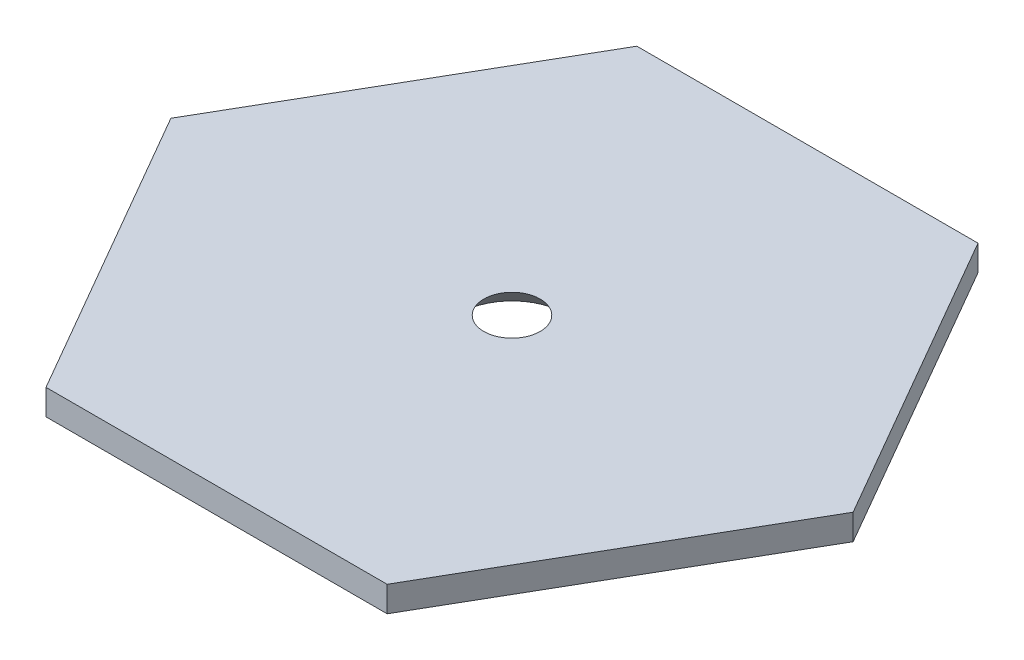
ISO-10303-21;
HEADER;
FILE_DESCRIPTION(('STEP AP214'),'2;1');
FILE_NAME('part.step','',(''),(''),'','','');
FILE_SCHEMA(('AUTOMOTIVE_DESIGN { 1 0 10303 214 1 1 1 1 }'));
ENDSEC;
DATA;
#1=APPLICATION_CONTEXT('core data for automotive mechanical design processes');
#2=APPLICATION_PROTOCOL_DEFINITION('international standard','automotive_design',2000,#1);
#3=PRODUCT_CONTEXT('',#1,'mechanical');
#4=PRODUCT('Part','Part','',(#3));
#5=PRODUCT_RELATED_PRODUCT_CATEGORY('part','',(#4));
#6=PRODUCT_DEFINITION_FORMATION('','',#4);
#7=PRODUCT_DEFINITION_CONTEXT('part definition',#1,'design');
#8=PRODUCT_DEFINITION('design','',#6,#7);
#9=PRODUCT_DEFINITION_SHAPE('','',#8);
#10=(LENGTH_UNIT() NAMED_UNIT(*) SI_UNIT(.MILLI.,.METRE.));
#11=(NAMED_UNIT(*) PLANE_ANGLE_UNIT() SI_UNIT($,.RADIAN.));
#12=(NAMED_UNIT(*) SI_UNIT($,.STERADIAN.) SOLID_ANGLE_UNIT());
#13=UNCERTAINTY_MEASURE_WITH_UNIT(LENGTH_MEASURE(1.E-05),#10,'distance_accuracy_value','');
#14=(GEOMETRIC_REPRESENTATION_CONTEXT(3) GLOBAL_UNCERTAINTY_ASSIGNED_CONTEXT((#13)) GLOBAL_UNIT_ASSIGNED_CONTEXT((#10,
#11,#12)) REPRESENTATION_CONTEXT('',''));
#15=CARTESIAN_POINT('',(0.,0.,0.));
#16=DIRECTION('',(0.,0.,1.));
#17=DIRECTION('',(1.,0.,0.));
#18=AXIS2_PLACEMENT_3D('',#15,#16,#17);
#19=CARTESIAN_POINT('',(20.,3.,34.6410161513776));
#20=DIRECTION('',(-0.866025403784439,0.,-0.5));
#21=DIRECTION('',(-0.5,0.,0.866025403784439));
#22=AXIS2_PLACEMENT_3D('',#19,#20,#21);
#23=PLANE('',#22);
#24=DIRECTION('',(0.5,0.,-0.866025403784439));
#25=VECTOR('',#24,1.);
#26=CARTESIAN_POINT('',(20.,0.,34.6410161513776));
#27=LINE('',#26,#25);
#28=CARTESIAN_POINT('',(20.,0.,34.6410161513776));
#29=VERTEX_POINT('',#28);
#30=CARTESIAN_POINT('',(40.,0.,0.));
#31=VERTEX_POINT('',#30);
#32=EDGE_CURVE('E86',#29,#31,#27,.T.);
#33=ORIENTED_EDGE('',*,*,#32,.T.);
#34=DIRECTION('',(0.,-1.,0.));
#35=VECTOR('',#34,1.);
#36=CARTESIAN_POINT('',(40.,3.,0.));
#37=LINE('',#36,#35);
#38=CARTESIAN_POINT('',(40.,3.,0.));
#39=VERTEX_POINT('',#38);
#40=EDGE_CURVE('E11',#39,#31,#37,.T.);
#41=ORIENTED_EDGE('',*,*,#40,.F.);
#42=DIRECTION('',(0.5,0.,-0.866025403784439));
#43=VECTOR('',#42,1.);
#44=CARTESIAN_POINT('',(20.,3.,34.6410161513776));
#45=LINE('',#44,#43);
#46=CARTESIAN_POINT('',(20.,3.,34.6410161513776));
#47=VERTEX_POINT('',#46);
#48=EDGE_CURVE('E114',#47,#39,#45,.T.);
#49=ORIENTED_EDGE('',*,*,#48,.F.);
#50=DIRECTION('',(0.,-1.,0.));
#51=VECTOR('',#50,1.);
#52=CARTESIAN_POINT('',(20.,3.,34.6410161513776));
#53=LINE('',#52,#51);
#54=EDGE_CURVE('E99',#47,#29,#53,.T.);
#55=ORIENTED_EDGE('',*,*,#54,.T.);
#56=EDGE_LOOP('',(#33,#41,#49,#55));
#57=FACE_BOUND('',#56,.T.);
#58=ADVANCED_FACE('F30',(#57),#23,.F.);
#59=CARTESIAN_POINT('',(40.,3.,0.));
#60=DIRECTION('',(-0.866025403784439,0.,0.5));
#61=DIRECTION('',(0.5,0.,0.866025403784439));
#62=AXIS2_PLACEMENT_3D('',#59,#60,#61);
#63=PLANE('',#62);
#64=DIRECTION('',(-0.5,0.,-0.866025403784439));
#65=VECTOR('',#64,1.);
#66=CARTESIAN_POINT('',(40.,0.,0.));
#67=LINE('',#66,#65);
#68=CARTESIAN_POINT('',(20.,0.,-34.6410161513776));
#69=VERTEX_POINT('',#68);
#70=EDGE_CURVE('E82',#31,#69,#67,.T.);
#71=ORIENTED_EDGE('',*,*,#70,.T.);
#72=DIRECTION('',(0.,-1.,0.));
#73=VECTOR('',#72,1.);
#74=CARTESIAN_POINT('',(20.,3.,-34.6410161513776));
#75=LINE('',#74,#73);
#76=CARTESIAN_POINT('',(20.,3.,-34.6410161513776));
#77=VERTEX_POINT('',#76);
#78=EDGE_CURVE('E37',#77,#69,#75,.T.);
#79=ORIENTED_EDGE('',*,*,#78,.F.);
#80=DIRECTION('',(-0.5,0.,-0.866025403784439));
#81=VECTOR('',#80,1.);
#82=CARTESIAN_POINT('',(40.,3.,0.));
#83=LINE('',#82,#81);
#84=EDGE_CURVE('E95',#39,#77,#83,.T.);
#85=ORIENTED_EDGE('',*,*,#84,.F.);
#86=ORIENTED_EDGE('',*,*,#40,.T.);
#87=EDGE_LOOP('',(#71,#79,#85,#86));
#88=FACE_BOUND('',#87,.T.);
#89=ADVANCED_FACE('F94',(#88),#63,.F.);
#90=CARTESIAN_POINT('',(20.,3.,-34.6410161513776));
#91=DIRECTION('',(0.,0.,1.));
#92=DIRECTION('',(1.,0.,0.));
#93=AXIS2_PLACEMENT_3D('',#90,#91,#92);
#94=PLANE('',#93);
#95=DIRECTION('',(-1.,0.,0.));
#96=VECTOR('',#95,1.);
#97=CARTESIAN_POINT('',(20.,0.,-34.6410161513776));
#98=LINE('',#97,#96);
#99=CARTESIAN_POINT('',(-20.,0.,-34.6410161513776));
#100=VERTEX_POINT('',#99);
#101=EDGE_CURVE('E88',#69,#100,#98,.T.);
#102=ORIENTED_EDGE('',*,*,#101,.T.);
#103=DIRECTION('',(0.,-1.,0.));
#104=VECTOR('',#103,1.);
#105=CARTESIAN_POINT('',(-20.,3.,-34.6410161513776));
#106=LINE('',#105,#104);
#107=CARTESIAN_POINT('',(-20.,3.,-34.6410161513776));
#108=VERTEX_POINT('',#107);
#109=EDGE_CURVE('E130',#108,#100,#106,.T.);
#110=ORIENTED_EDGE('',*,*,#109,.F.);
#111=DIRECTION('',(-1.,0.,0.));
#112=VECTOR('',#111,1.);
#113=CARTESIAN_POINT('',(20.,3.,-34.6410161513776));
#114=LINE('',#113,#112);
#115=EDGE_CURVE('E117',#77,#108,#114,.T.);
#116=ORIENTED_EDGE('',*,*,#115,.F.);
#117=ORIENTED_EDGE('',*,*,#78,.T.);
#118=EDGE_LOOP('',(#102,#110,#116,#117));
#119=FACE_BOUND('',#118,.T.);
#120=ADVANCED_FACE('F134',(#119),#94,.F.);
#121=CARTESIAN_POINT('',(-20.,3.,-34.6410161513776));
#122=DIRECTION('',(0.866025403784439,0.,0.5));
#123=DIRECTION('',(0.5,0.,-0.866025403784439));
#124=AXIS2_PLACEMENT_3D('',#121,#122,#123);
#125=PLANE('',#124);
#126=DIRECTION('',(-0.5,0.,0.866025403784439));
#127=VECTOR('',#126,1.);
#128=CARTESIAN_POINT('',(-20.,0.,-34.6410161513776));
#129=LINE('',#128,#127);
#130=CARTESIAN_POINT('',(-40.,0.,0.));
#131=VERTEX_POINT('',#130);
#132=EDGE_CURVE('E108',#100,#131,#129,.T.);
#133=ORIENTED_EDGE('',*,*,#132,.T.);
#134=DIRECTION('',(0.,-1.,0.));
#135=VECTOR('',#134,1.);
#136=CARTESIAN_POINT('',(-40.,3.,0.));
#137=LINE('',#136,#135);
#138=CARTESIAN_POINT('',(-40.,3.,0.));
#139=VERTEX_POINT('',#138);
#140=EDGE_CURVE('E127',#139,#131,#137,.T.);
#141=ORIENTED_EDGE('',*,*,#140,.F.);
#142=DIRECTION('',(-0.5,0.,0.866025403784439));
#143=VECTOR('',#142,1.);
#144=CARTESIAN_POINT('',(-20.,3.,-34.6410161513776));
#145=LINE('',#144,#143);
#146=EDGE_CURVE('E119',#108,#139,#145,.T.);
#147=ORIENTED_EDGE('',*,*,#146,.F.);
#148=ORIENTED_EDGE('',*,*,#109,.T.);
#149=EDGE_LOOP('',(#133,#141,#147,#148));
#150=FACE_BOUND('',#149,.T.);
#151=ADVANCED_FACE('F140',(#150),#125,.F.);
#152=CARTESIAN_POINT('',(-40.,3.,0.));
#153=DIRECTION('',(0.866025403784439,0.,-0.5));
#154=DIRECTION('',(-0.5,0.,-0.866025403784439));
#155=AXIS2_PLACEMENT_3D('',#152,#153,#154);
#156=PLANE('',#155);
#157=DIRECTION('',(0.5,0.,0.866025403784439));
#158=VECTOR('',#157,1.);
#159=CARTESIAN_POINT('',(-40.,0.,0.));
#160=LINE('',#159,#158);
#161=CARTESIAN_POINT('',(-20.,0.,34.6410161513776));
#162=VERTEX_POINT('',#161);
#163=EDGE_CURVE('E110',#131,#162,#160,.T.);
#164=ORIENTED_EDGE('',*,*,#163,.T.);
#165=DIRECTION('',(0.,-1.,0.));
#166=VECTOR('',#165,1.);
#167=CARTESIAN_POINT('',(-20.,3.,34.6410161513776));
#168=LINE('',#167,#166);
#169=CARTESIAN_POINT('',(-20.,3.,34.6410161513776));
#170=VERTEX_POINT('',#169);
#171=EDGE_CURVE('E124',#170,#162,#168,.T.);
#172=ORIENTED_EDGE('',*,*,#171,.F.);
#173=DIRECTION('',(0.5,0.,0.866025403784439));
#174=VECTOR('',#173,1.);
#175=CARTESIAN_POINT('',(-40.,3.,0.));
#176=LINE('',#175,#174);
#177=EDGE_CURVE('E49',#139,#170,#176,.T.);
#178=ORIENTED_EDGE('',*,*,#177,.F.);
#179=ORIENTED_EDGE('',*,*,#140,.T.);
#180=EDGE_LOOP('',(#164,#172,#178,#179));
#181=FACE_BOUND('',#180,.T.);
#182=ADVANCED_FACE('F143',(#181),#156,.F.);
#183=CARTESIAN_POINT('',(-20.,3.,34.6410161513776));
#184=DIRECTION('',(0.,0.,-1.));
#185=DIRECTION('',(-1.,0.,0.));
#186=AXIS2_PLACEMENT_3D('',#183,#184,#185);
#187=PLANE('',#186);
#188=DIRECTION('',(1.,0.,0.));
#189=VECTOR('',#188,1.);
#190=CARTESIAN_POINT('',(-20.,0.,34.6410161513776));
#191=LINE('',#190,#189);
#192=EDGE_CURVE('E112',#162,#29,#191,.T.);
#193=ORIENTED_EDGE('',*,*,#192,.T.);
#194=ORIENTED_EDGE('',*,*,#54,.F.);
#195=DIRECTION('',(1.,0.,0.));
#196=VECTOR('',#195,1.);
#197=CARTESIAN_POINT('',(-20.,3.,34.6410161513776));
#198=LINE('',#197,#196);
#199=EDGE_CURVE('E44',#170,#47,#198,.T.);
#200=ORIENTED_EDGE('',*,*,#199,.F.);
#201=ORIENTED_EDGE('',*,*,#171,.T.);
#202=EDGE_LOOP('',(#193,#194,#200,#201));
#203=FACE_BOUND('',#202,.T.);
#204=ADVANCED_FACE('F145',(#203),#187,.F.);
#205=CARTESIAN_POINT('',(20.,3.,34.6410161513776));
#206=DIRECTION('',(0.,-1.,0.));
#207=DIRECTION('',(0.,0.,-1.));
#208=AXIS2_PLACEMENT_3D('',#205,#206,#207);
#209=PLANE('',#208);
#210=CARTESIAN_POINT('',(0.,3.,0.));
#211=DIRECTION('',(0.,-1.,0.));
#212=DIRECTION('',(0.,0.,-1.));
#213=AXIS2_PLACEMENT_3D('',#210,#211,#212);
#214=CIRCLE('',#213,3.29999999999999);
#215=CARTESIAN_POINT('',(0.,3.,-3.29999999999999));
#216=VERTEX_POINT('',#215);
#217=EDGE_CURVE('E100',#216,#216,#214,.T.);
#218=ORIENTED_EDGE('',*,*,#217,.T.);
#219=EDGE_LOOP('',(#218));
#220=FACE_BOUND('',#219,.T.);
#221=ORIENTED_EDGE('',*,*,#48,.T.);
#222=ORIENTED_EDGE('',*,*,#84,.T.);
#223=ORIENTED_EDGE('',*,*,#115,.T.);
#224=ORIENTED_EDGE('',*,*,#146,.T.);
#225=ORIENTED_EDGE('',*,*,#177,.T.);
#226=ORIENTED_EDGE('',*,*,#199,.T.);
#227=EDGE_LOOP('',(#221,#222,#223,#224,#225,#226));
#228=FACE_BOUND('',#227,.T.);
#229=ADVANCED_FACE('F137',(#220,#228),#209,.F.);
#230=CARTESIAN_POINT('',(20.,0.,34.6410161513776));
#231=DIRECTION('',(0.,-1.,0.));
#232=DIRECTION('',(0.,0.,-1.));
#233=AXIS2_PLACEMENT_3D('',#230,#231,#232);
#234=PLANE('',#233);
#235=CARTESIAN_POINT('',(0.,0.,0.));
#236=DIRECTION('',(0.,-1.,0.));
#237=DIRECTION('',(0.,0.,-1.));
#238=AXIS2_PLACEMENT_3D('',#235,#236,#237);
#239=CIRCLE('',#238,6.3);
#240=CARTESIAN_POINT('',(0.,0.,-6.3));
#241=VERTEX_POINT('',#240);
#242=EDGE_CURVE('E103',#241,#241,#239,.T.);
#243=ORIENTED_EDGE('',*,*,#242,.F.);
#244=EDGE_LOOP('',(#243));
#245=FACE_BOUND('',#244,.T.);
#246=ORIENTED_EDGE('',*,*,#32,.F.);
#247=ORIENTED_EDGE('',*,*,#192,.F.);
#248=ORIENTED_EDGE('',*,*,#163,.F.);
#249=ORIENTED_EDGE('',*,*,#132,.F.);
#250=ORIENTED_EDGE('',*,*,#101,.F.);
#251=ORIENTED_EDGE('',*,*,#70,.F.);
#252=EDGE_LOOP('',(#246,#247,#248,#249,#250,#251));
#253=FACE_BOUND('',#252,.T.);
#254=ADVANCED_FACE('F83',(#245,#253),#234,.T.);
#255=CARTESIAN_POINT('',(0.,0.,0.));
#256=DIRECTION('',(0.,-1.,0.));
#257=DIRECTION('',(0.,0.,-1.));
#258=AXIS2_PLACEMENT_3D('',#255,#256,#257);
#259=CONICAL_SURFACE('',#258,6.3,0.785398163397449);
#260=ORIENTED_EDGE('',*,*,#242,.T.);
#261=EDGE_LOOP('',(#260));
#262=FACE_BOUND('',#261,.T.);
#263=ORIENTED_EDGE('',*,*,#217,.F.);
#264=EDGE_LOOP('',(#263));
#265=FACE_BOUND('',#264,.T.);
#266=ADVANCED_FACE('F192',(#262,#265),#259,.F.);
#267=CLOSED_SHELL('',(#58,#89,#120,#151,#182,#204,#229,#254,#266));
#268=MANIFOLD_SOLID_BREP('B2',#267);
#269=ADVANCED_BREP_SHAPE_REPRESENTATION('',(#18,#268),#14);
#270=SHAPE_DEFINITION_REPRESENTATION(#9,#269);
ENDSEC;
END-ISO-10303-21;
